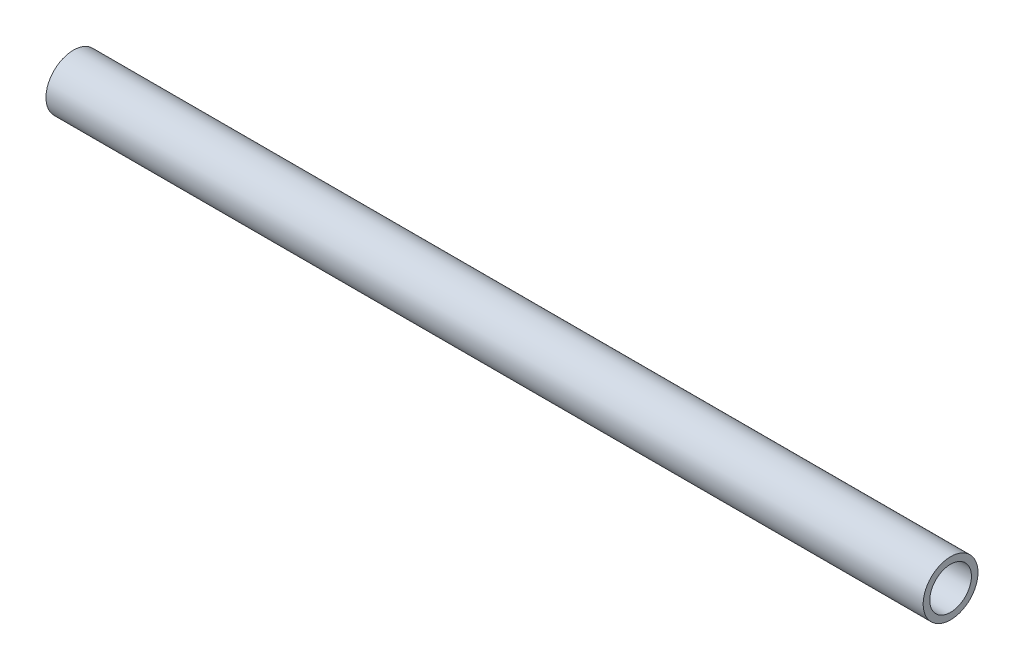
from build123d import *

# Parameters (mm, degrees)
SKETCH11_R                                     = 12.5
SKETCH11_R_2                                   = 9.5
C_PROGRAM_FILES_SOLIDWORKS_CORP_SOLIDWOR_DEPTH = 400


with BuildPart() as part:
    # Sketch11 → C_PROGRAM FILES_SOLIDWORKS CORP_SOLIDWOR (new body)
    with BuildSketch(Plane.YZ):
        Circle(SKETCH11_R)
        Circle(SKETCH11_R_2, mode=Mode.SUBTRACT)
    extrude(amount=C_PROGRAM_FILES_SOLIDWORKS_CORP_SOLIDWOR_DEPTH)


solid = part.part
